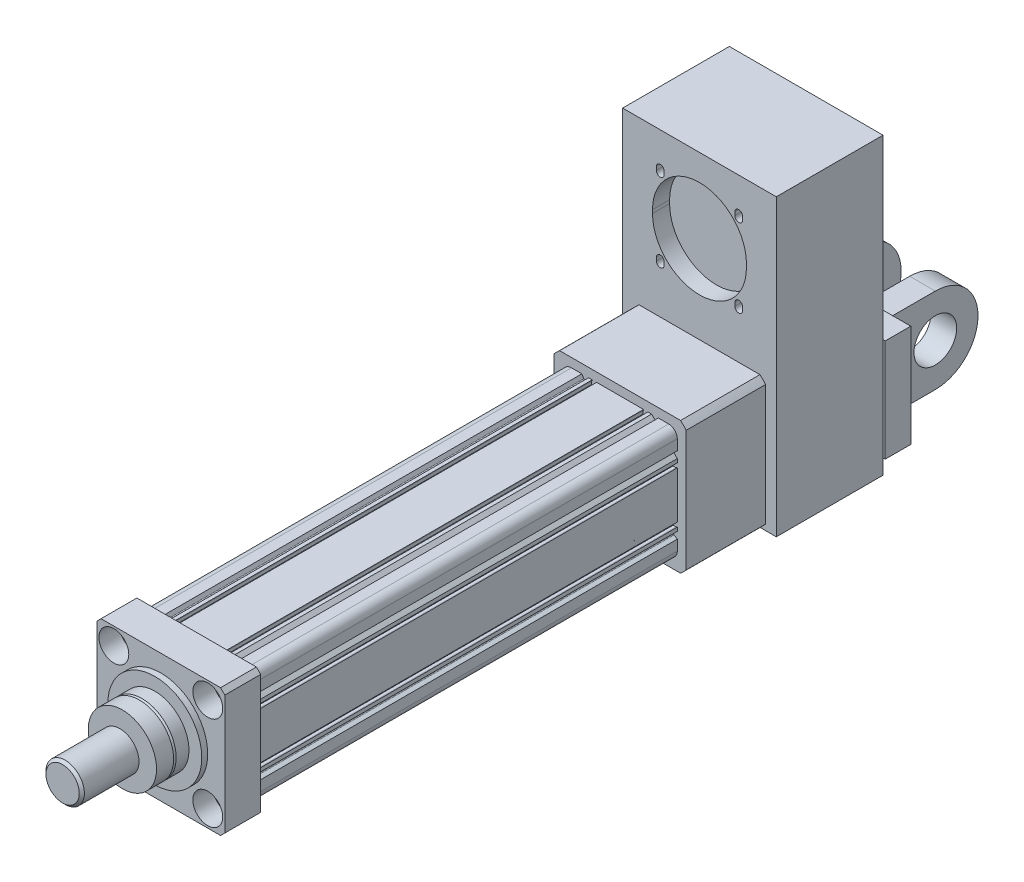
from build123d import *

# Parameters (mm, degrees)
SKETCH_1_R          = 6
EXTRUDE_1_DEPTH     = 496
EXTRUDE_1_2_DEPTH   = 42
SKETCH_3_R          = 6.5
SKETCH_3_R_2        = 8.5
CUT_EXTRUDE_1_DEPTH = 42
SKETCH_3_3_R        = 17.5
SKETCH_3_3_R_2      = 8.5
CUT_EXTRUDE_2_DEPTH = 24
SKETCH_3_4_R        = 55
EXTRUDE_2_DEPTH     = 7
SKETCH_4_R          = 40
EXTRUDE_3_DEPTH     = 18
CHAMFER_1_SIZE      = 3
CHAMFER_1_SIZE2     = 1.091910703
SKETCH_5_R          = 40
EXTRUDE_4_DEPTH     = 20
SKETCH_6_R          = 16.5
EXTRUDE_5_DEPTH     = 3
SKETCH_7_R          = 22.5
EXTRUDE_6_DEPTH     = 67
FILLET_1_R          = 1
CHAMFER_2_SIZE      = 3
EXTRUDE_7_DEPTH     = 93
SKETCH_12_W         = 180
SKETCH_12_H         = 345
EXTRUDE_9_DEPTH     = 125
CUT_EXTRUDE_5_DEPTH = 20
CUT_EXTRUDE_6_DEPTH = 20
SKETCH_16_W         = 182.5
SKETCH_16_H         = 120
EXTRUDE_10_DEPTH    = 30
SKETCH_16_3_W       = 30
SKETCH_16_3_H       = 100
EXTRUDE_11_DEPTH    = 140
SKETCH_17_R         = 25
CUT_EXTRUDE_9_DEPTH = 140
CHAMFER_3_SIZE      = 8


with BuildPart() as part:
    # Sketch 1 → Extrude 1 (new body)
    with BuildSketch(Plane.XY):
        with BuildLine():
            Line((57, 67), (44.8, 67))
            Line((44.8, 67), (42.56486134, 63.12862628))
            ThreePointArc((42.56486134, 63.12862628), (41.829362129, 62.637181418), (40.991729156, 62.921519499))
            Line((40.991729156, 62.921519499), (36.913248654, 67))
            Line((36.913248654, 67), (32.6, 67))
            Line((32.6, 67), (32.6, 66.1))
            Line((32.6, 66.1), (33.2, 65.5))
            Line((33.2, 65.5), (33.2, 62))
            Line((33.2, 62), (26.9, 62))
            Line((26.9, 62), (26.9, 65.5))
            Line((26.9, 65.5), (27.5, 66.1))
            Line((27.5, 66.1), (27.5, 67))
            Line((27.5, 67), (0, 67))
            Line((0, 67), (-27.5, 67))
            Line((-27.5, 67), (-27.5, 66.1))
            Line((-27.5, 66.1), (-26.9, 65.5))
            Line((-26.9, 65.5), (-26.9, 62))
            Line((-26.9, 62), (-33.2, 62))
            Line((-33.2, 62), (-33.2, 65.5))
            Line((-33.2, 65.5), (-32.6, 66.1))
            Line((-32.6, 66.1), (-32.6, 67))
            Line((-32.6, 67), (-36.913248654, 67))
            Line((-36.913248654, 67), (-40.991729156, 62.921519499))
            ThreePointArc((-40.991729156, 62.921519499), (-41.829362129, 62.637181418), (-42.56486134, 63.12862628))
            Line((-42.56486134, 63.12862628), (-44.8, 67))
            Line((-44.8, 67), (-57, 67))
            ThreePointArc((-57, 67), (-64.071067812, 64.071067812), (-67, 57))
            Line((-67, 57), (-67, 44.8))
            Line((-67, 44.8), (-63.12862628, 42.56486134))
            ThreePointArc((-63.12862628, 42.56486134), (-62.637181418, 41.829362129), (-62.921519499, 40.991729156))
            Line((-62.921519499, 40.991729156), (-67, 36.913248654))
            Line((-67, 36.913248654), (-67, 32.6))
            Line((-67, 32.6), (-66.1, 32.6))
            Line((-66.1, 32.6), (-65.5, 33.2))
            Line((-65.5, 33.2), (-62, 33.2))
            Line((-62, 33.2), (-62, 26.9))
            Line((-62, 26.9), (-65.5, 26.9))
            Line((-65.5, 26.9), (-66.1, 27.5))
            Line((-66.1, 27.5), (-67, 27.5))
            Line((-67, 27.5), (-67, 0))
            Line((-67, 0), (-67, -27.5))
            Line((-67, -27.5), (-66.1, -27.5))
            Line((-66.1, -27.5), (-65.5, -26.9))
            Line((-65.5, -26.9), (-62, -26.9))
            Line((-62, -26.9), (-62, -33.2))
            Line((-62, -33.2), (-65.5, -33.2))
            Line((-65.5, -33.2), (-66.1, -32.6))
            Line((-66.1, -32.6), (-67, -32.6))
            Line((-67, -32.6), (-67, -36.913248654))
            Line((-67, -36.913248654), (-62.921519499, -40.991729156))
            ThreePointArc((-62.921519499, -40.991729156), (-62.637181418, -41.829362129), (-63.12862628, -42.56486134))
            Line((-63.12862628, -42.56486134), (-67, -44.8))
            Line((-67, -44.8), (-67, -57))
            ThreePointArc((-67, -57), (-64.071067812, -64.071067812), (-57, -67))
            Line((-57, -67), (-44.8, -67))
            Line((-44.8, -67), (-42.56486134, -63.12862628))
            ThreePointArc((-42.56486134, -63.12862628), (-41.829362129, -62.637181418), (-40.991729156, -62.921519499))
            Line((-40.991729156, -62.921519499), (-36.913248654, -67))
            Line((-36.913248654, -67), (36.913248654, -67))
            Line((36.913248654, -67), (40.991729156, -62.921519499))
            ThreePointArc((40.991729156, -62.921519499), (41.829362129, -62.637181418), (42.56486134, -63.12862628))
            Line((42.56486134, -63.12862628), (44.8, -67))
            Line((44.8, -67), (57, -67))
            ThreePointArc((57, -67), (64.071067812, -64.071067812), (67, -57))
            Line((67, -57), (67, -44.8))
            Line((67, -44.8), (63.12862628, -42.56486134))
            ThreePointArc((63.12862628, -42.56486134), (62.637181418, -41.829362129), (62.921519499, -40.991729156))
            Line((62.921519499, -40.991729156), (67, -36.913248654))
            Line((67, -36.913248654), (67, -32.6))
            Line((67, -32.6), (66.1, -32.6))
            Line((66.1, -32.6), (65.5, -33.2))
            Line((65.5, -33.2), (62, -33.2))
            Line((62, -33.2), (62, -26.9))
            Line((62, -26.9), (65.5, -26.9))
            Line((65.5, -26.9), (66.1, -27.5))
            Line((66.1, -27.5), (67, -27.5))
            Line((67, -27.5), (67, 0))
            Line((67, 0), (67, 27.5))
            Line((67, 27.5), (66.1, 27.5))
            Line((66.1, 27.5), (65.5, 26.9))
            Line((65.5, 26.9), (62, 26.9))
            Line((62, 26.9), (62, 33.2))
            Line((62, 33.2), (65.5, 33.2))
            Line((65.5, 33.2), (66.1, 32.6))
            Line((66.1, 32.6), (67, 32.6))
            Line((67, 32.6), (67, 36.913248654))
            Line((67, 36.913248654), (62.921519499, 40.991729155))
            ThreePointArc((62.921519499, 40.991729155), (62.637181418, 41.829362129), (63.12862628, 42.56486134))
            Line((63.12862628, 42.56486134), (67, 44.8))
            Line((67, 44.8), (67, 57))
            ThreePointArc((67, 57), (64.071067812, 64.071067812), (57, 67))
        make_face()
        with Locations((-55, 55)):
            Circle(SKETCH_1_R, mode=Mode.SUBTRACT)
        with Locations((55, 55)):
            Circle(SKETCH_1_R, mode=Mode.SUBTRACT)
        with Locations((-55, -55)):
            Circle(SKETCH_1_R, mode=Mode.SUBTRACT)
        with Locations((55, -55)):
            Circle(SKETCH_1_R, mode=Mode.SUBTRACT)
        with BuildLine():
            Line((41.774779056, 51.785063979), (43.601329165, 54.94874157))
            ThreePointArc((43.601329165, 54.94874157), (43.701229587, 55.707560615), (43.235303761, 56.314766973))
            Line((43.235303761, 56.314766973), (39.616756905, 58.403935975))
            ThreePointArc((39.616756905, 58.403935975), (39.337726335, 58.513191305), (39.038853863, 58.534871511))
            Line((39.038853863, 58.534871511), (35.747329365, 58.277670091))
            ThreePointArc((35.747329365, 58.277670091), (35.481311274, 58.1068038), (35.28193171, 57.86142918))
            Line((35.28193171, 57.86142918), (34.274000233, 56.115640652))
            ThreePointArc((34.274000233, 56.115640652), (34.174099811, 55.356821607), (34.640025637, 54.749615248))
            Line((34.640025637, 54.749615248), (40.408753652, 51.419038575))
            ThreePointArc((40.408753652, 51.419038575), (41.167572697, 51.319138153), (41.774779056, 51.785063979))
        make_face(mode=Mode.SUBTRACT)
        with BuildLine():
            Line((51.785063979, 41.774779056), (54.94874157, 43.601329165))
            ThreePointArc((54.94874157, 43.601329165), (55.707560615, 43.701229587), (56.314766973, 43.235303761))
            Line((56.314766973, 43.235303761), (58.403935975, 39.616756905))
            ThreePointArc((58.403935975, 39.616756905), (58.513191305, 39.337726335), (58.534871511, 39.038853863))
            Line((58.534871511, 39.038853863), (58.277670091, 35.747329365))
            ThreePointArc((58.277670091, 35.747329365), (58.1068038, 35.481311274), (57.86142918, 35.28193171))
            Line((57.86142918, 35.28193171), (56.115640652, 34.274000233))
            ThreePointArc((56.115640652, 34.274000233), (55.356821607, 34.174099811), (54.749615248, 34.640025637))
            Line((54.749615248, 34.640025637), (51.419038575, 40.408753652))
            ThreePointArc((51.419038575, 40.408753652), (51.319138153, 41.167572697), (51.785063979, 41.774779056))
        make_face(mode=Mode.SUBTRACT)
        with BuildLine():
            Line((-57.86142918, 35.28193171), (-56.115640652, 34.274000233))
            ThreePointArc((-56.115640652, 34.274000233), (-55.356821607, 34.174099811), (-54.749615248, 34.640025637))
            Line((-54.749615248, 34.640025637), (-51.419038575, 40.408753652))
            ThreePointArc((-51.419038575, 40.408753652), (-51.319138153, 41.167572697), (-51.785063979, 41.774779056))
            Line((-51.785063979, 41.774779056), (-54.94874157, 43.601329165))
            ThreePointArc((-54.94874157, 43.601329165), (-55.707560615, 43.701229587), (-56.314766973, 43.235303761))
            Line((-56.314766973, 43.235303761), (-58.403935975, 39.616756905))
            ThreePointArc((-58.403935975, 39.616756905), (-58.513191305, 39.337726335), (-58.534871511, 39.038853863))
            Line((-58.534871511, 39.038853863), (-58.277670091, 35.747329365))
            ThreePointArc((-58.277670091, 35.747329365), (-58.1068038, 35.481311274), (-57.86142918, 35.28193171))
        make_face(mode=Mode.SUBTRACT)
        with BuildLine():
            Line((-33.360371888, -64.600232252), (-19.423193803, -64.600232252))
            ThreePointArc((-19.423193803, -64.600232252), (-18.434155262, -63.747889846), (-19.1311157, -62.643837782))
            ThreePointArc((-19.1311157, -62.643837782), (-26.690004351, -59.815496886), (-33.843674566, -56.079012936))
            ThreePointArc((-33.843674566, -56.079012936), (-34.851952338, -56.064348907), (-35.360371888, -56.935181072))
            Line((-35.360371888, -56.935181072), (-35.360371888, -62.600232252))
            Line((-35.360371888, -62.600232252), (-33.360371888, -64.600232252))
        make_face(mode=Mode.SUBTRACT)
        with BuildLine():
            Line((35.360371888, -62.600232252), (33.360371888, -64.600232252))
            Line((33.360371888, -64.600232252), (19.423193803, -64.600232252))
            ThreePointArc((19.423193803, -64.600232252), (18.434155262, -63.747889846), (19.1311157, -62.643837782))
            ThreePointArc((19.1311157, -62.643837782), (26.690004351, -59.815496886), (33.843674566, -56.079012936))
            ThreePointArc((33.843674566, -56.079012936), (34.851952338, -56.064348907), (35.360371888, -56.935181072))
            Line((35.360371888, -56.935181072), (35.360371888, -62.600232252))
        make_face(mode=Mode.SUBTRACT)
        with BuildLine():
            Line((51.785063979, -41.774779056), (54.94874157, -43.601329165))
            ThreePointArc((54.94874157, -43.601329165), (55.707560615, -43.701229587), (56.314766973, -43.235303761))
            Line((56.314766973, -43.235303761), (58.403935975, -39.616756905))
            ThreePointArc((58.403935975, -39.616756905), (58.513191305, -39.337726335), (58.534871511, -39.038853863))
            Line((58.534871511, -39.038853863), (58.277670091, -35.747329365))
            ThreePointArc((58.277670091, -35.747329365), (58.1068038, -35.481311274), (57.86142918, -35.28193171))
            Line((57.86142918, -35.28193171), (56.115640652, -34.274000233))
            ThreePointArc((56.115640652, -34.274000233), (55.356821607, -34.174099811), (54.749615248, -34.640025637))
            Line((54.749615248, -34.640025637), (51.419038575, -40.408753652))
            ThreePointArc((51.419038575, -40.408753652), (51.319138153, -41.167572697), (51.785063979, -41.774779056))
        make_face(mode=Mode.SUBTRACT)
        with BuildLine():
            Line((-57.86142918, -35.28193171), (-56.115640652, -34.274000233))
            ThreePointArc((-56.115640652, -34.274000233), (-55.356821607, -34.174099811), (-54.749615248, -34.640025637))
            Line((-54.749615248, -34.640025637), (-51.419038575, -40.408753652))
            ThreePointArc((-51.419038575, -40.408753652), (-51.319138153, -41.167572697), (-51.785063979, -41.774779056))
            Line((-51.785063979, -41.774779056), (-54.94874157, -43.601329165))
            ThreePointArc((-54.94874157, -43.601329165), (-55.707560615, -43.701229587), (-56.314766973, -43.235303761))
            Line((-56.314766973, -43.235303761), (-58.403935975, -39.616756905))
            ThreePointArc((-58.403935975, -39.616756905), (-58.513191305, -39.337726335), (-58.534871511, -39.038853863))
            Line((-58.534871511, -39.038853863), (-58.277670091, -35.747329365))
            ThreePointArc((-58.277670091, -35.747329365), (-58.1068038, -35.481311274), (-57.86142918, -35.28193171))
        make_face(mode=Mode.SUBTRACT)
        with BuildLine():
            Line((-41.774779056, 51.785063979), (-43.601329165, 54.94874157))
            ThreePointArc((-43.601329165, 54.94874157), (-43.701229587, 55.707560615), (-43.235303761, 56.314766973))
            Line((-43.235303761, 56.314766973), (-39.616756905, 58.403935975))
            ThreePointArc((-39.616756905, 58.403935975), (-39.337726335, 58.513191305), (-39.038853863, 58.534871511))
            Line((-39.038853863, 58.534871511), (-35.747329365, 58.277670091))
            ThreePointArc((-35.747329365, 58.277670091), (-35.481311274, 58.1068038), (-35.28193171, 57.86142918))
            Line((-35.28193171, 57.86142918), (-34.274000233, 56.115640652))
            ThreePointArc((-34.274000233, 56.115640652), (-34.174099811, 55.356821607), (-34.640025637, 54.749615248))
            Line((-34.640025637, 54.749615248), (-40.408753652, 51.419038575))
            ThreePointArc((-40.408753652, 51.419038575), (-41.167572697, 51.319138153), (-41.774779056, 51.785063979))
        make_face(mode=Mode.SUBTRACT)
        with BuildLine():
            ThreePointArc((62.5, 0), (0, 62.5), (-62.5, 0))
            ThreePointArc((-62.5, 0), (0, -62.5), (62.5, 0))
        make_face(mode=Mode.SUBTRACT)
    extrude(amount=EXTRUDE_1_DEPTH)

    # Sketch 2 → Extrude 1 2 (add)
    with BuildSketch(Plane.XY.offset(496)):
        Polygon((-75, 70), (-70, 75), (70, 75), (75, 70), (75, -70), (70, -75), (-70, -75), (-75, -70), align=None)
    extrude(amount=EXTRUDE_1_2_DEPTH)

    # Sketch 3 → Cut-Extrude 1 (cut)
    with BuildSketch(Plane.XY.offset(538)):
        with Locations((-85, 20)):
            Circle(SKETCH_3_R)
        with Locations((-85, -20)):
            Circle(SKETCH_3_R)
        with Locations((-85, -60)):
            Circle(SKETCH_3_R)
        with Locations((-55, -55)):
            Circle(SKETCH_3_R_2)
        with Locations((-55, 55)):
            Circle(SKETCH_3_R_2)
        with Locations((55, 55)):
            Circle(SKETCH_3_R_2)
        with Locations((85, 60)):
            Circle(SKETCH_3_R)
        with Locations((85, 20)):
            Circle(SKETCH_3_R)
        with Locations((85, -20)):
            Circle(SKETCH_3_R)
        with Locations((85, -60)):
            Circle(SKETCH_3_R)
        with Locations((55, -55)):
            Circle(SKETCH_3_R_2)
        with Locations((-85, 60)):
            Circle(SKETCH_3_R)
    extrude(amount=-CUT_EXTRUDE_1_DEPTH, mode=Mode.SUBTRACT)

    # Sketch 3_3 → Cut-Extrude 2 (cut)
    # profile 1 of 4: a face of its own
    with BuildSketch(Plane.XY.offset(538)):
        with Locations((55, 55)):
            Circle(SKETCH_3_3_R)
        with Locations((55, 55)):
            Circle(SKETCH_3_3_R_2, mode=Mode.SUBTRACT)
    # profile 2 of 4: a face of its own
    with BuildSketch(Plane.XY.offset(538)):
        with Locations((55, -55)):
            Circle(SKETCH_3_3_R)
        with Locations((55, -55)):
            Circle(SKETCH_3_3_R_2, mode=Mode.SUBTRACT)
    # profile 3 of 4: a face of its own
    with BuildSketch(Plane.XY.offset(538)):
        with Locations((-55, -55)):
            Circle(SKETCH_3_3_R)
        with Locations((-55, -55)):
            Circle(SKETCH_3_3_R_2, mode=Mode.SUBTRACT)
    # profile 4 of 4: a face of its own
    with BuildSketch(Plane.XY.offset(538)):
        with Locations((-55, 55)):
            Circle(SKETCH_3_3_R)
    extrude(amount=-CUT_EXTRUDE_2_DEPTH, mode=Mode.SUBTRACT)

    # Sketch 3_4 → Extrude 2 (add)
    with BuildSketch(Plane.XY.offset(538)):
        with Locations(Location((0, 0, 0), (0, 0, 180))):
            Circle(SKETCH_3_4_R)
    extrude(amount=EXTRUDE_2_DEPTH)

    # Sketch 4 → Extrude 3 (add)
    with BuildSketch(Plane.XY.offset(545)):
        Circle(SKETCH_4_R)
    extrude(amount=EXTRUDE_3_DEPTH)

    # Chamfer 1
    chamfer_1_edges = [part.edges().sort_by_distance(p)[0] for p in [
        (-40, 0, 563),
    ]]
    chamfer_1_side = [part.faces().sort_by_distance(p)[0] for p in [
        (-40, 0, 554),
    ]]
    chamfer(chamfer_1_edges, length=CHAMFER_1_SIZE, length2=CHAMFER_1_SIZE2, reference=chamfer_1_side[0])

    # Sketch 5 → Extrude 4 (add)
    with BuildSketch(Plane.XY.offset(563)):
        Circle(SKETCH_5_R)
    extrude(amount=EXTRUDE_4_DEPTH)

    # Sketch 6 → Extrude 5 (add)
    with BuildSketch(Plane.XY.offset(583)):
        Circle(SKETCH_6_R)
    extrude(amount=EXTRUDE_5_DEPTH)

    # Sketch 7 → Extrude 6 (add)
    with BuildSketch(Plane.XY.offset(586)):
        Circle(SKETCH_7_R)
    extrude(amount=EXTRUDE_6_DEPTH)

    # Fillet 1
    fillet_1_edges = [part.edges().sort_by_distance(p)[0] for p in [
        (-16.5, 0, 583),
    ]]
    fillet(fillet_1_edges, radius=FILLET_1_R)

    # Chamfer 2
    chamfer_2_edges = [part.edges().sort_by_distance(p)[0] for p in [
        (-22.5, 0, 653),
    ]]
    chamfer(chamfer_2_edges, length=CHAMFER_2_SIZE)

    # Sketch 8 → Extrude 7 (add)
    with BuildSketch(Plane(origin=(0, 0, 0), x_dir=(-1, 0, 0), z_dir=(0, 0, -1))):
        with BuildLine():
            Line((-70.843136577, 77.5), (70.843136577, 77.5))
            ThreePointArc((70.843136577, 77.5), (74.246212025, 74.246212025), (77.5, 70.843136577))
            Line((77.5, 70.843136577), (77.5, -70.843136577))
            ThreePointArc((77.5, -70.843136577), (74.246212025, -74.246212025), (70.843136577, -77.5))
            Line((70.843136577, -77.5), (-70.843136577, -77.5))
            ThreePointArc((-70.843136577, -77.5), (-74.246212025, -74.246212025), (-77.5, -70.843136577))
            Line((-77.5, -70.843136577), (-77.5, 70.843136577))
            ThreePointArc((-77.5, 70.843136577), (-74.246212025, 74.246212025), (-70.843136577, 77.5))
        make_face()
    extrude(amount=EXTRUDE_7_DEPTH)

    # Sketch 12 → Extrude 9 (add)
    with BuildSketch(Plane(origin=(0, 0, -93), x_dir=(-1, 0, 0), z_dir=(0, 0, -1))):
        with Locations((0, 95)):
            Rectangle(SKETCH_12_W, SKETCH_12_H)
    extrude(amount=EXTRUDE_9_DEPTH)

    # Sketch 13 → Cut-Extrude 5 (cut)
    with BuildSketch(Plane.XY.offset(-93)):
        with BuildLine():
            Line((-55, 182), (-55, 178))
            ThreePointArc((-55, 178), (0, 123), (55, 178))
            Line((55, 178), (55, 182))
            ThreePointArc((55, 182), (0, 237), (-55, 182))
        make_face()
    extrude(amount=-CUT_EXTRUDE_5_DEPTH, mode=Mode.SUBTRACT)

    # Sketch 13_3 → Cut-Extrude 6 (cut)
    with BuildSketch(Plane.XY.offset(-93)):
        with BuildLine():
            Line((-50.461940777, 223.961940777), (-50.461940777, 227.961940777))
            ThreePointArc((-50.461940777, 227.961940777), (-45.961940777, 232.461940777), (-41.461940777, 227.961940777))
            Line((-41.461940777, 227.961940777), (-41.461940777, 223.961940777))
            ThreePointArc((-41.461940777, 223.961940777), (-45.961940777, 219.461940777), (-50.461940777, 223.961940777))
        make_face()
        with BuildLine():
            Line((50.461940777, 223.961940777), (50.461940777, 227.961940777))
            ThreePointArc((50.461940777, 227.961940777), (45.961940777, 232.461940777), (41.461940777, 227.961940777))
            Line((41.461940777, 227.961940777), (41.461940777, 223.961940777))
            ThreePointArc((41.461940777, 223.961940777), (45.961940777, 219.461940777), (50.461940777, 223.961940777))
        make_face()
        with BuildLine():
            Line((50.461940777, 136.038059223), (50.461940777, 132.038059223))
            ThreePointArc((50.461940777, 132.038059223), (45.961940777, 127.538059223), (41.461940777, 132.038059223))
            Line((41.461940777, 132.038059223), (41.461940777, 136.038059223))
            ThreePointArc((41.461940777, 136.038059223), (45.961940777, 140.538059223), (50.461940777, 136.038059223))
        make_face()
        with BuildLine():
            Line((-50.461940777, 136.038059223), (-50.461940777, 132.038059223))
            ThreePointArc((-50.461940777, 132.038059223), (-45.961940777, 127.538059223), (-41.461940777, 132.038059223))
            Line((-41.461940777, 132.038059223), (-41.461940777, 136.038059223))
            ThreePointArc((-41.461940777, 136.038059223), (-45.961940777, 140.538059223), (-50.461940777, 136.038059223))
        make_face()
    extrude(amount=-CUT_EXTRUDE_6_DEPTH, mode=Mode.SUBTRACT)



with BuildPart() as body_2:
    # Sketch 16 → Extrude 10 (new body)
    with BuildSketch(Plane(origin=(0, 0, -218), x_dir=(-1, 0, 0), z_dir=(0, 0, -1))):
        with Locations((-1.25, 0)):
            Rectangle(SKETCH_16_W, SKETCH_16_H)
    extrude(amount=EXTRUDE_10_DEPTH)


with BuildPart() as part_1:
    add(part.part)

    add(body_2.part)  # Extrude 11 merges body 2
    # Sketch 16_3 → Extrude 11 (add)
    with BuildSketch(Plane(origin=(0, 0, -218), x_dir=(-1, 0, 0), z_dir=(0, 0, -1))):
        with Locations((-46.25, 0)):
            Rectangle(SKETCH_16_3_W, SKETCH_16_3_H)
        with Locations((43.75, 0)):
            Rectangle(SKETCH_16_3_W, SKETCH_16_3_H)
    extrude(amount=EXTRUDE_11_DEPTH)

    # Sketch 17 → Cut-Extrude 9 (cut)
    with BuildSketch(Plane.ZY.offset(58.75)):
        with Locations(Location((-308, 0, 0), (0, 0, 270))):
            Circle(SKETCH_17_R)
        with BuildLine():
            Line((-308, 50), (-475.820169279, 67.469338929))
            Line((-475.820169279, 67.469338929), (-443.053523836, -106.081585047))
            Line((-443.053523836, -106.081585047), (-308, -50))
            ThreePointArc((-308, -50), (-358, 0), (-308, 50))
        make_face()
    extrude(amount=-CUT_EXTRUDE_9_DEPTH, mode=Mode.SUBTRACT)

    # Chamfer 3
    chamfer_3_edges = [part_1.edges().sort_by_distance(p)[0] for p in [
        (46.25, 50, -248),
        (31.25, 0, -248),
        (61.25, 0, -248),
        (46.25, -50, -248),
        (-43.75, 50, -248),
        (-58.75, 0, -248),
        (-43.75, -50, -248),
        (-28.75, 0, -248),
    ]]
    chamfer(chamfer_3_edges, length=CHAMFER_3_SIZE)


solid = part_1.part
